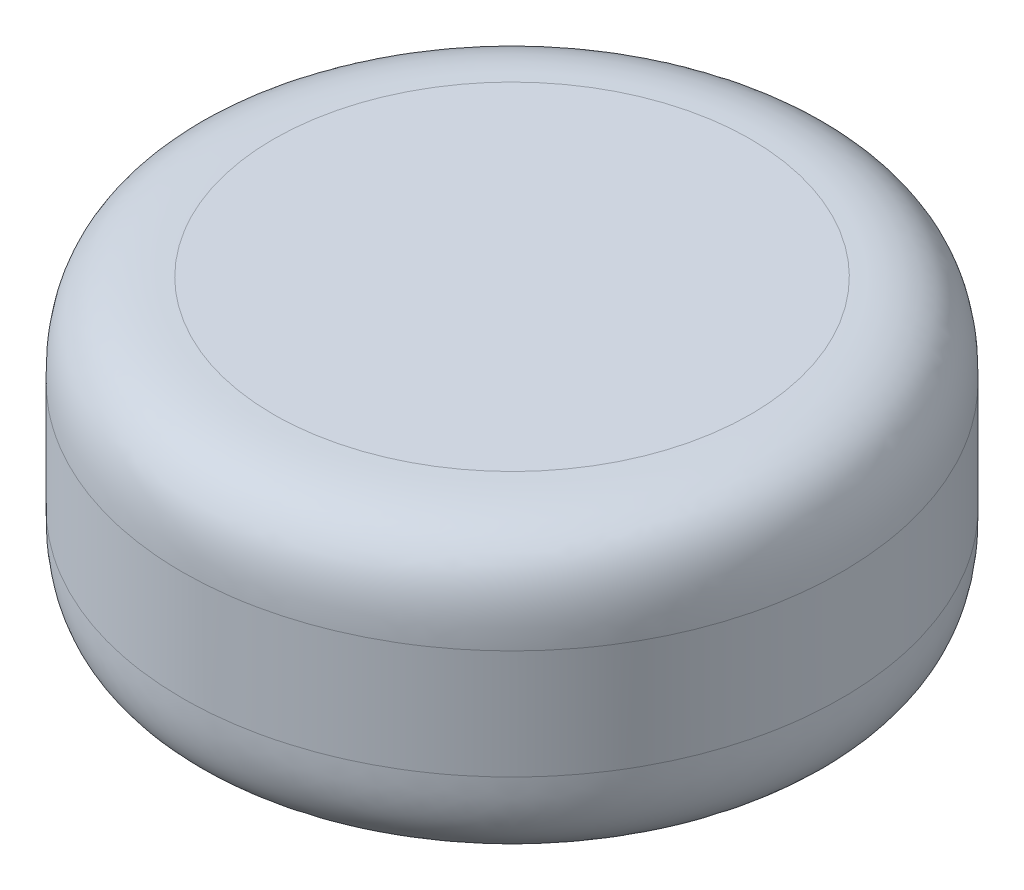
ISO-10303-21;
HEADER;
FILE_DESCRIPTION(('STEP AP214'),'2;1');
FILE_NAME('part.step','',(''),(''),'','','');
FILE_SCHEMA(('AUTOMOTIVE_DESIGN { 1 0 10303 214 1 1 1 1 }'));
ENDSEC;
DATA;
#1=APPLICATION_CONTEXT('core data for automotive mechanical design processes');
#2=APPLICATION_PROTOCOL_DEFINITION('international standard','automotive_design',2000,#1);
#3=PRODUCT_CONTEXT('',#1,'mechanical');
#4=PRODUCT('Part','Part','',(#3));
#5=PRODUCT_RELATED_PRODUCT_CATEGORY('part','',(#4));
#6=PRODUCT_DEFINITION_FORMATION('','',#4);
#7=PRODUCT_DEFINITION_CONTEXT('part definition',#1,'design');
#8=PRODUCT_DEFINITION('design','',#6,#7);
#9=PRODUCT_DEFINITION_SHAPE('','',#8);
#10=(LENGTH_UNIT() NAMED_UNIT(*) SI_UNIT(.MILLI.,.METRE.));
#11=(NAMED_UNIT(*) PLANE_ANGLE_UNIT() SI_UNIT($,.RADIAN.));
#12=(NAMED_UNIT(*) SI_UNIT($,.STERADIAN.) SOLID_ANGLE_UNIT());
#13=UNCERTAINTY_MEASURE_WITH_UNIT(LENGTH_MEASURE(1.E-05),#10,'distance_accuracy_value','');
#14=(GEOMETRIC_REPRESENTATION_CONTEXT(3) GLOBAL_UNCERTAINTY_ASSIGNED_CONTEXT((#13)) GLOBAL_UNIT_ASSIGNED_CONTEXT((#10,
#11,#12)) REPRESENTATION_CONTEXT('',''));
#15=CARTESIAN_POINT('',(0.,0.,0.));
#16=DIRECTION('',(0.,0.,1.));
#17=DIRECTION('',(1.,0.,0.));
#18=AXIS2_PLACEMENT_3D('',#15,#16,#17);
#19=CARTESIAN_POINT('',(-3.33066907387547E-13,4.06399999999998,0.));
#20=DIRECTION('',(0.,-1.,0.));
#21=DIRECTION('',(0.,0.,-1.));
#22=AXIS2_PLACEMENT_3D('',#19,#20,#21);
#23=CYLINDRICAL_SURFACE('',#22,4.5974);
#24=CARTESIAN_POINT('',(0.,2.794,4.59740000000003));
#25=CARTESIAN_POINT('',(0.601717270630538,2.794,4.59740000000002));
#26=CARTESIAN_POINT('',(1.80515181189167,2.794,4.3580219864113));
#27=CARTESIAN_POINT('',(3.3354856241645,2.79399999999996,3.33548562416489));
#28=CARTESIAN_POINT('',(4.35802198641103,2.79399999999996,1.80515181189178));
#29=CARTESIAN_POINT('',(4.71708900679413,2.79399999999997,0.));
#30=CARTESIAN_POINT('',(4.35802198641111,2.79399999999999,-1.80515181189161));
#31=CARTESIAN_POINT('',(3.33548562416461,2.794,-3.33548562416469));
#32=CARTESIAN_POINT('',(1.80515181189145,2.794,-4.35802198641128));
#33=CARTESIAN_POINT('',(-1.38777878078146E-13,2.79399999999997,-4.71708900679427));
#34=CARTESIAN_POINT('',(-1.80515181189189,2.79399999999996,-4.35802198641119));
#35=CARTESIAN_POINT('',(-3.33548562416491,2.79399999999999,-3.33548562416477));
#36=CARTESIAN_POINT('',(-4.35802198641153,2.79399999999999,-1.80515181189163));
#37=CARTESIAN_POINT('',(-4.71708900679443,2.79399999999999,0.));
#38=CARTESIAN_POINT('',(-4.35802198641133,2.79399999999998,1.8051518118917));
#39=CARTESIAN_POINT('',(-3.33548562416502,2.79400000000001,3.33548562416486));
#40=CARTESIAN_POINT('',(-1.80515181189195,2.79400000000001,4.35802198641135));
#41=CARTESIAN_POINT('',(-0.601717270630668,2.794,4.59740000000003));
#42=CARTESIAN_POINT('',(0.,2.794,4.59740000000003));
#43=B_SPLINE_CURVE_WITH_KNOTS('',3,(#24,#25,#26,#27,#28,#29,#30,#31,#32,#33,#34,#35,#36,#37,#38,
#39,#40,#41,#42),.UNSPECIFIED.,.T.,.F.,(4,1,1,1,1,1,1,1,1,1,1,1,1,1,1,1,4),(0.,
0.392699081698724,0.785398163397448,1.17809724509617,1.5707963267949,1.96349540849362,
2.35619449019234,2.74889357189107,3.14159265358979,3.53429173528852,3.92699081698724,
4.31968989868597,4.71238898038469,5.10508806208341,5.49778714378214,5.89048622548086,
6.28318530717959),.UNSPECIFIED.);
#44=CARTESIAN_POINT('',(0.,2.794,4.59740000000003));
#45=VERTEX_POINT('',#44);
#46=EDGE_CURVE('E12',#45,#45,#43,.F.);
#47=ORIENTED_EDGE('',*,*,#46,.T.);
#48=EDGE_LOOP('',(#47));
#49=FACE_BOUND('',#48,.T.);
#50=CARTESIAN_POINT('',(-2.69478449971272E-13,1.26999999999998,4.59740000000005));
#51=CARTESIAN_POINT('',(-0.601717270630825,1.26999999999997,4.59740000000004));
#52=CARTESIAN_POINT('',(-1.80515181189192,1.26999999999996,4.35802198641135));
#53=CARTESIAN_POINT('',(-3.33548562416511,1.26999999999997,3.33548562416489));
#54=CARTESIAN_POINT('',(-4.35802198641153,1.26999999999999,1.80515181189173));
#55=CARTESIAN_POINT('',(-4.71708900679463,1.27000000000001,0.));
#56=CARTESIAN_POINT('',(-4.3580219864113,1.27,-1.8051518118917));
#57=CARTESIAN_POINT('',(-3.3354856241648,1.26999999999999,-3.33548562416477));
#58=CARTESIAN_POINT('',(-1.80515181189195,1.27,-4.35802198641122));
#59=CARTESIAN_POINT('',(-2.4980018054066E-13,1.27,-4.71708900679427));
#60=CARTESIAN_POINT('',(1.80515181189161,1.26999999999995,-4.35802198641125));
#61=CARTESIAN_POINT('',(3.3354856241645,1.26999999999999,-3.33548562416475));
#62=CARTESIAN_POINT('',(4.35802198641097,1.27000000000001,-1.80515181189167));
#63=CARTESIAN_POINT('',(4.71708900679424,1.27,0.));
#64=CARTESIAN_POINT('',(4.35802198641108,1.27000000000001,1.80515181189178));
#65=CARTESIAN_POINT('',(3.33548562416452,1.27,3.33548562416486));
#66=CARTESIAN_POINT('',(1.80515181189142,1.26999999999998,4.35802198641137));
#67=CARTESIAN_POINT('',(0.601717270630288,1.26999999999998,4.59740000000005));
#68=CARTESIAN_POINT('',(-2.68882138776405E-13,1.26999999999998,4.59740000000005));
#69=B_SPLINE_CURVE_WITH_KNOTS('',3,(#50,#51,#52,#53,#54,#55,#56,#57,#58,#59,#60,#61,#62,#63,#64,
#65,#66,#67,#68),.UNSPECIFIED.,.T.,.F.,(4,1,1,1,1,1,1,1,1,1,1,1,1,1,1,1,4),(0.,
0.392699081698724,0.785398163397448,1.17809724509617,1.5707963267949,1.96349540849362,
2.35619449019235,2.74889357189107,3.14159265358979,3.53429173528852,3.92699081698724,
4.31968989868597,4.71238898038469,5.10508806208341,5.49778714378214,5.89048622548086,
6.28318530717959),.UNSPECIFIED.);
#70=CARTESIAN_POINT('',(-2.69478449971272E-13,1.26999999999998,4.59740000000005));
#71=VERTEX_POINT('',#70);
#72=EDGE_CURVE('E69',#71,#71,#69,.F.);
#73=ORIENTED_EDGE('',*,*,#72,.T.);
#74=EDGE_LOOP('',(#73));
#75=FACE_BOUND('',#74,.T.);
#76=ADVANCED_FACE('F46',(#49,#75),#23,.T.);
#77=CARTESIAN_POINT('',(-3.33066907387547E-13,4.06399999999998,0.));
#78=DIRECTION('',(0.,1.,0.));
#79=DIRECTION('',(0.,0.,1.));
#80=AXIS2_PLACEMENT_3D('',#77,#78,#79);
#81=PLANE('',#80);
#82=CARTESIAN_POINT('',(-1.16443313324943E-13,4.06399999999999,3.32740000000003));
#83=CARTESIAN_POINT('',(-0.435497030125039,4.06399999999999,3.32740000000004));
#84=CARTESIAN_POINT('',(-1.30649109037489,4.06400000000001,3.15414850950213));
#85=CARTESIAN_POINT('',(-2.41408075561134,4.06399999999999,2.41408075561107));
#86=CARTESIAN_POINT('',(-3.15414850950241,4.064,1.30649109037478));
#87=CARTESIAN_POINT('',(-3.41402574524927,4.06400000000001,1.38777878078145E-13));
#88=CARTESIAN_POINT('',(-3.15414850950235,4.06399999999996,-1.3064910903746));
#89=CARTESIAN_POINT('',(-2.41408075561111,4.06399999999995,-2.41408075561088));
#90=CARTESIAN_POINT('',(-1.30649109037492,4.06399999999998,-3.15414850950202));
#91=CARTESIAN_POINT('',(0.,4.064,-3.41402574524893));
#92=CARTESIAN_POINT('',(1.30649109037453,4.06399999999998,-3.15414850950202));
#93=CARTESIAN_POINT('',(2.41408075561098,4.06399999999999,-2.41408075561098));
#94=CARTESIAN_POINT('',(3.15414850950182,4.06399999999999,-1.30649109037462));
#95=CARTESIAN_POINT('',(3.41402574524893,4.064,0.));
#96=CARTESIAN_POINT('',(3.15414850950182,4.06399999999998,1.30649109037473));
#97=CARTESIAN_POINT('',(2.41408075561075,4.06400000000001,2.41408075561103));
#98=CARTESIAN_POINT('',(1.30649109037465,4.064,3.1541485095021));
#99=CARTESIAN_POINT('',(0.435497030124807,4.06399999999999,3.32740000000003));
#100=CARTESIAN_POINT('',(-1.16036737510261E-13,4.06399999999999,3.32740000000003));
#101=B_SPLINE_CURVE_WITH_KNOTS('',3,(#82,#83,#84,#85,#86,#87,#88,#89,#90,#91,#92,#93,#94,#95,
#96,#97,#98,#99,#100),.UNSPECIFIED.,.T.,.F.,(4,1,1,1,1,1,1,1,1,1,1,1,1,1,1,1,4),(0.,
0.392699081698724,0.785398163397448,1.17809724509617,1.5707963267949,1.96349540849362,
2.35619449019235,2.74889357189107,3.14159265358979,3.53429173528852,3.92699081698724,
4.31968989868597,4.71238898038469,5.10508806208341,5.49778714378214,5.89048622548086,
6.28318530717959),.UNSPECIFIED.);
#102=CARTESIAN_POINT('',(-1.16443313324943E-13,4.06399999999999,3.32740000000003));
#103=VERTEX_POINT('',#102);
#104=EDGE_CURVE('E59',#103,#103,#101,.F.);
#105=ORIENTED_EDGE('',*,*,#104,.T.);
#106=EDGE_LOOP('',(#105));
#107=FACE_BOUND('',#106,.T.);
#108=ADVANCED_FACE('F92',(#107),#81,.T.);
#109=CARTESIAN_POINT('',(0.,0.,0.));
#110=DIRECTION('',(0.,1.,0.));
#111=DIRECTION('',(0.,0.,1.));
#112=AXIS2_PLACEMENT_3D('',#109,#110,#111);
#113=PLANE('',#112);
#114=CARTESIAN_POINT('',(-2.36301863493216E-13,0.,3.32740000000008));
#115=CARTESIAN_POINT('',(0.435497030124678,0.,3.32740000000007));
#116=CARTESIAN_POINT('',(1.30649109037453,0.,3.15414850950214));
#117=CARTESIAN_POINT('',(2.41408075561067,0.,2.41408075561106));
#118=CARTESIAN_POINT('',(3.15414850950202,0.,1.30649109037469));
#119=CARTESIAN_POINT('',(3.41402574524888,0.,0.));
#120=CARTESIAN_POINT('',(3.1541485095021,0.,-1.30649109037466));
#121=CARTESIAN_POINT('',(2.41408075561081,0.,-2.41408075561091));
#122=CARTESIAN_POINT('',(1.30649109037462,0.,-3.15414850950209));
#123=CARTESIAN_POINT('',(-2.4980018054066E-13,0.,-3.41402574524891));
#124=CARTESIAN_POINT('',(-1.30649109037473,0.,-3.15414850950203));
#125=CARTESIAN_POINT('',(-2.4140807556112,0.,-2.41408075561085));
#126=CARTESIAN_POINT('',(-3.15414850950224,0.,-1.30649109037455));
#127=CARTESIAN_POINT('',(-3.41402574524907,0.,0.));
#128=CARTESIAN_POINT('',(-3.15414850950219,0.,1.30649109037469));
#129=CARTESIAN_POINT('',(-2.41408075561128,0.,2.41408075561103));
#130=CARTESIAN_POINT('',(-1.30649109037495,0.,3.15414850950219));
#131=CARTESIAN_POINT('',(-0.43549703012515,0.,3.32740000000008));
#132=CARTESIAN_POINT('',(-2.3673554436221E-13,0.,3.32740000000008));
#133=B_SPLINE_CURVE_WITH_KNOTS('',3,(#114,#115,#116,#117,#118,#119,#120,#121,#122,#123,#124,
#125,#126,#127,#128,#129,#130,#131,#132),.UNSPECIFIED.,.T.,.F.,(4,1,1,1,1,1,1,1,1,1,1,1,1,1,1,1,
4),(0.,0.392699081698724,0.785398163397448,1.17809724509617,1.5707963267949,1.96349540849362,
2.35619449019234,2.74889357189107,3.14159265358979,3.53429173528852,3.92699081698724,
4.31968989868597,4.71238898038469,5.10508806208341,5.49778714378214,5.89048622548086,
6.28318530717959),.UNSPECIFIED.);
#134=CARTESIAN_POINT('',(-2.36301863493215E-13,0.,3.32740000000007));
#135=VERTEX_POINT('',#134);
#136=EDGE_CURVE('E64',#135,#135,#133,.F.);
#137=ORIENTED_EDGE('',*,*,#136,.T.);
#138=EDGE_LOOP('',(#137));
#139=FACE_BOUND('',#138,.T.);
#140=ADVANCED_FACE('F93',(#139),#113,.F.);
#141=CARTESIAN_POINT('',(-2.68882138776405E-13,1.26999999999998,4.59740000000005));
#142=CARTESIAN_POINT('',(0.601717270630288,1.26999999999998,4.59740000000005));
#143=CARTESIAN_POINT('',(1.80515181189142,1.26999999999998,4.35802198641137));
#144=CARTESIAN_POINT('',(3.33548562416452,1.27,3.33548562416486));
#145=CARTESIAN_POINT('',(4.35802198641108,1.27000000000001,1.80515181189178));
#146=CARTESIAN_POINT('',(4.71708900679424,1.27,0.));
#147=CARTESIAN_POINT('',(4.35802198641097,1.27000000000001,-1.80515181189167));
#148=CARTESIAN_POINT('',(3.3354856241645,1.26999999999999,-3.33548562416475));
#149=CARTESIAN_POINT('',(1.80515181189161,1.26999999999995,-4.35802198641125));
#150=CARTESIAN_POINT('',(-2.4980018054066E-13,1.27,-4.71708900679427));
#151=CARTESIAN_POINT('',(-1.80515181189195,1.27,-4.35802198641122));
#152=CARTESIAN_POINT('',(-3.3354856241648,1.26999999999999,-3.33548562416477));
#153=CARTESIAN_POINT('',(-4.3580219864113,1.27,-1.8051518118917));
#154=CARTESIAN_POINT('',(-4.71708900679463,1.27000000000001,0.));
#155=CARTESIAN_POINT('',(-4.35802198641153,1.26999999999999,1.80515181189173));
#156=CARTESIAN_POINT('',(-3.33548562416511,1.26999999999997,3.33548562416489));
#157=CARTESIAN_POINT('',(-1.80515181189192,1.26999999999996,4.35802198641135));
#158=CARTESIAN_POINT('',(-0.601717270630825,1.26999999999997,4.59740000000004));
#159=CARTESIAN_POINT('',(-2.68882138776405E-13,1.26999999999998,4.59740000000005));
#160=CARTESIAN_POINT('',(-1.81007552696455E-13,1.05638847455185,4.59740000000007));
#161=CARTESIAN_POINT('',(0.601717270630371,1.05638847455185,4.59740000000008));
#162=CARTESIAN_POINT('',(1.8051518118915,1.05638847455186,4.35802198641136));
#163=CARTESIAN_POINT('',(3.33548562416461,1.05638847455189,3.33548562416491));
#164=CARTESIAN_POINT('',(4.35802198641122,1.05638847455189,1.80515181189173));
#165=CARTESIAN_POINT('',(4.71708900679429,1.05638847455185,0.));
#166=CARTESIAN_POINT('',(4.35802198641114,1.05638847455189,-1.80515181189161));
#167=CARTESIAN_POINT('',(3.33548562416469,1.05638847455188,-3.33548562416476));
#168=CARTESIAN_POINT('',(1.80515181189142,1.05638847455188,-4.35802198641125));
#169=CARTESIAN_POINT('',(-1.11022302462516E-13,1.05638847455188,-4.71708900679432));
#170=CARTESIAN_POINT('',(-1.80515181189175,1.05638847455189,-4.3580219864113));
#171=CARTESIAN_POINT('',(-3.33548562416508,1.05638847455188,-3.33548562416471));
#172=CARTESIAN_POINT('',(-4.35802198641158,1.05638847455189,-1.80515181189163));
#173=CARTESIAN_POINT('',(-4.71708900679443,1.05638847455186,0.));
#174=CARTESIAN_POINT('',(-4.35802198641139,1.05638847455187,1.80515181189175));
#175=CARTESIAN_POINT('',(-3.33548562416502,1.05638847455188,3.33548562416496));
#176=CARTESIAN_POINT('',(-1.80515181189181,1.05638847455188,4.35802198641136));
#177=CARTESIAN_POINT('',(-0.601717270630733,1.05638847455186,4.59740000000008));
#178=CARTESIAN_POINT('',(-1.81007552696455E-13,1.05638847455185,4.59740000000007));
#179=CARTESIAN_POINT('',(-2.41072353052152E-13,0.842776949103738,4.59740000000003));
#180=CARTESIAN_POINT('',(0.601717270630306,0.842776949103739,4.59740000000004));
#181=CARTESIAN_POINT('',(1.80515181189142,0.842776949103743,4.35802198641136));
#182=CARTESIAN_POINT('',(3.33548562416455,0.84277694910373,3.33548562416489));
#183=CARTESIAN_POINT('',(4.35802198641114,0.842776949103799,1.80515181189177));
#184=CARTESIAN_POINT('',(4.71708900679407,0.842776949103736,0.));
#185=CARTESIAN_POINT('',(4.35802198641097,0.842776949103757,-1.80515181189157));
#186=CARTESIAN_POINT('',(3.33548562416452,0.842776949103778,-3.33548562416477));
#187=CARTESIAN_POINT('',(1.80515181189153,0.842776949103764,-4.35802198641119));
#188=CARTESIAN_POINT('',(-2.77555756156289E-13,0.842776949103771,-4.71708900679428));
#189=CARTESIAN_POINT('',(-1.805151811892,0.842776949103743,-4.35802198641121));
#190=CARTESIAN_POINT('',(-3.33548562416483,0.842776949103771,-3.33548562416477));
#191=CARTESIAN_POINT('',(-4.3580219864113,0.842776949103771,-1.8051518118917));
#192=CARTESIAN_POINT('',(-4.71708900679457,0.842776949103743,0.));
#193=CARTESIAN_POINT('',(-4.35802198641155,0.842776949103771,1.80515181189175));
#194=CARTESIAN_POINT('',(-3.33548562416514,0.84277694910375,3.33548562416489));
#195=CARTESIAN_POINT('',(-1.80515181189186,0.842776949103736,4.35802198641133));
#196=CARTESIAN_POINT('',(-0.601717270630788,0.842776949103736,4.59740000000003));
#197=CARTESIAN_POINT('',(-2.41072353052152E-13,0.842776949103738,4.59740000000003));
#198=CARTESIAN_POINT('',(-2.54950140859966E-13,0.371974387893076,4.50635126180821));
#199=CARTESIAN_POINT('',(0.58980062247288,0.371974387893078,4.50635126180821));
#200=CARTESIAN_POINT('',(1.76940186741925,0.371974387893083,4.27171398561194));
#201=CARTESIAN_POINT('',(3.26942834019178,0.371974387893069,3.26942834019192));
#202=CARTESIAN_POINT('',(4.27171398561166,0.371974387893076,1.7694018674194));
#203=CARTESIAN_POINT('',(4.6236698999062,0.371974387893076,0.));
#204=CARTESIAN_POINT('',(4.27171398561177,0.371974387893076,-1.76940186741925));
#205=CARTESIAN_POINT('',(3.26942834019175,0.371974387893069,-3.26942834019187));
#206=CARTESIAN_POINT('',(1.76940186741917,0.37197438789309,-4.27171398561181));
#207=CARTESIAN_POINT('',(-3.05311331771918E-13,0.371974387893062,-4.62366989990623));
#208=CARTESIAN_POINT('',(-1.76940186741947,0.371974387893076,-4.27171398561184));
#209=CARTESIAN_POINT('',(-3.26942834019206,0.371974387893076,-3.26942834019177));
#210=CARTESIAN_POINT('',(-4.27171398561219,0.371974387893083,-1.76940186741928));
#211=CARTESIAN_POINT('',(-4.62366989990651,0.37197438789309,0.));
#212=CARTESIAN_POINT('',(-4.27171398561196,0.371974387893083,1.76940186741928));
#213=CARTESIAN_POINT('',(-3.269428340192,0.371974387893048,3.26942834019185));
#214=CARTESIAN_POINT('',(-1.76940186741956,0.371974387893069,4.27171398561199));
#215=CARTESIAN_POINT('',(-0.589800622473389,0.371974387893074,4.50635126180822));
#216=CARTESIAN_POINT('',(-2.54950140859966E-13,0.371974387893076,4.50635126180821));
#217=CARTESIAN_POINT('',(-2.41018142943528E-13,0.0910487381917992,4.225425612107));
#218=CARTESIAN_POINT('',(0.553032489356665,0.0910487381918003,4.225425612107));
#219=CARTESIAN_POINT('',(1.65909746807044,0.0910487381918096,4.00541560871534));
#220=CARTESIAN_POINT('',(3.0656123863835,0.0910487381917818,3.06561238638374));
#221=CARTESIAN_POINT('',(4.00541560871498,0.0910487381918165,1.65909746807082));
#222=CARTESIAN_POINT('',(4.33543061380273,0.0910487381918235,0.));
#223=CARTESIAN_POINT('',(4.00541560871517,0.0910487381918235,-1.65909746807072));
#224=CARTESIAN_POINT('',(3.06561238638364,0.0910487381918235,-3.06561238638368));
#225=CARTESIAN_POINT('',(1.65909746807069,0.0910487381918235,-4.0054156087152));
#226=CARTESIAN_POINT('',(-3.88578058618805E-13,0.0910487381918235,-4.3354306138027));
#227=CARTESIAN_POINT('',(-1.6590974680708,0.0910487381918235,-4.00541560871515));
#228=CARTESIAN_POINT('',(-3.06561238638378,0.0910487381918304,-3.06561238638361));
#229=CARTESIAN_POINT('',(-4.00541560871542,0.0910487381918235,-1.65909746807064));
#230=CARTESIAN_POINT('',(-4.33543061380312,0.0910487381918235,1.11022302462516E-13));
#231=CARTESIAN_POINT('',(-4.00541560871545,0.0910487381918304,1.65909746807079));
#232=CARTESIAN_POINT('',(-3.06561238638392,0.0910487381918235,3.06561238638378));
#233=CARTESIAN_POINT('',(-1.659097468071,0.0910487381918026,4.00541560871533));
#234=CARTESIAN_POINT('',(-0.553032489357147,0.091048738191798,4.22542561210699));
#235=CARTESIAN_POINT('',(-2.41018142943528E-13,0.0910487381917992,4.225425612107));
#236=CARTESIAN_POINT('',(-1.62359275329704E-13,0.,3.75462305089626));
#237=CARTESIAN_POINT('',(0.491412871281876,0.,3.75462305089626));
#238=CARTESIAN_POINT('',(1.47423861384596,0.,3.55912685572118));
#239=CARTESIAN_POINT('',(2.72403776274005,0.,2.72403776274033));
#240=CARTESIAN_POINT('',(3.55912685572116,0.,1.47423861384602));
#241=CARTESIAN_POINT('',(3.85237114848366,0.,0.));
#242=CARTESIAN_POINT('',(3.55912685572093,0.,-1.47423861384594));
#243=CARTESIAN_POINT('',(2.72403776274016,0.,-2.72403776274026));
#244=CARTESIAN_POINT('',(1.47423861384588,0.,-3.55912685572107));
#245=CARTESIAN_POINT('',(-3.33066907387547E-13,0.,-3.85237114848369));
#246=CARTESIAN_POINT('',(-1.47423861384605,0.,-3.55912685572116));
#247=CARTESIAN_POINT('',(-2.72403776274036,0.,-2.72403776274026));
#248=CARTESIAN_POINT('',(-3.5591268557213,0.,-1.47423861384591));
#249=CARTESIAN_POINT('',(-3.85237114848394,0.,1.2490009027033E-13));
#250=CARTESIAN_POINT('',(-3.55912685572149,0.,1.47423861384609));
#251=CARTESIAN_POINT('',(-2.72403776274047,0.,2.72403776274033));
#252=CARTESIAN_POINT('',(-1.47423861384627,0.,3.55912685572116));
#253=CARTESIAN_POINT('',(-0.491412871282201,0.,3.75462305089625));
#254=CARTESIAN_POINT('',(-1.62359275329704E-13,0.,3.75462305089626));
#255=CARTESIAN_POINT('',(0.,0.,3.54101152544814));
#256=CARTESIAN_POINT('',(0.46345495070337,0.,3.54101152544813));
#257=CARTESIAN_POINT('',(1.39036485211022,0.,3.35663768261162));
#258=CARTESIAN_POINT('',(2.56905925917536,0.,2.56905925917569));
#259=CARTESIAN_POINT('',(3.35663768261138,0.,1.39036485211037));
#260=CARTESIAN_POINT('',(3.63319844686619,0.,0.));
#261=CARTESIAN_POINT('',(3.35663768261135,0.,-1.39036485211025));
#262=CARTESIAN_POINT('',(2.56905925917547,0.,-2.56905925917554));
#263=CARTESIAN_POINT('',(1.39036485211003,0.,-3.35663768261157));
#264=CARTESIAN_POINT('',(-2.4980018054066E-13,0.,-3.6331984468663));
#265=CARTESIAN_POINT('',(-1.39036485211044,0.,-3.35663768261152));
#266=CARTESIAN_POINT('',(-2.56905925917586,0.,-2.56905925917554));
#267=CARTESIAN_POINT('',(-3.35663768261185,0.,-1.39036485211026));
#268=CARTESIAN_POINT('',(-3.63319844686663,0.,0.));
#269=CARTESIAN_POINT('',(-3.35663768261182,0.,1.39036485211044));
#270=CARTESIAN_POINT('',(-2.56905925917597,0.,2.56905925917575));
#271=CARTESIAN_POINT('',(-1.39036485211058,0.,3.35663768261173));
#272=CARTESIAN_POINT('',(-0.463454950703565,0.,3.54101152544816));
#273=CARTESIAN_POINT('',(0.,0.,3.54101152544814));
#274=CARTESIAN_POINT('',(-2.36301863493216E-13,0.,3.32740000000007));
#275=CARTESIAN_POINT('',(0.435497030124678,0.,3.32740000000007));
#276=CARTESIAN_POINT('',(1.30649109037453,0.,3.15414850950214));
#277=CARTESIAN_POINT('',(2.41408075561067,0.,2.41408075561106));
#278=CARTESIAN_POINT('',(3.15414850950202,0.,1.30649109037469));
#279=CARTESIAN_POINT('',(3.41402574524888,0.,0.));
#280=CARTESIAN_POINT('',(3.1541485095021,0.,-1.30649109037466));
#281=CARTESIAN_POINT('',(2.41408075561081,0.,-2.41408075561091));
#282=CARTESIAN_POINT('',(1.30649109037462,0.,-3.15414850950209));
#283=CARTESIAN_POINT('',(-2.4980018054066E-13,0.,-3.41402574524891));
#284=CARTESIAN_POINT('',(-1.30649109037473,0.,-3.15414850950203));
#285=CARTESIAN_POINT('',(-2.4140807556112,0.,-2.41408075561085));
#286=CARTESIAN_POINT('',(-3.15414850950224,0.,-1.30649109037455));
#287=CARTESIAN_POINT('',(-3.41402574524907,0.,0.));
#288=CARTESIAN_POINT('',(-3.15414850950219,0.,1.30649109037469));
#289=CARTESIAN_POINT('',(-2.41408075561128,0.,2.41408075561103));
#290=CARTESIAN_POINT('',(-1.30649109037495,0.,3.15414850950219));
#291=CARTESIAN_POINT('',(-0.43549703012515,0.,3.32740000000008));
#292=CARTESIAN_POINT('',(-2.36301863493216E-13,0.,3.32740000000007));
#293=B_SPLINE_SURFACE_WITH_KNOTS('',5,3,((#141,#142,#143,#144,#145,#146,#147,#148,#149,#150,
#151,#152,#153,#154,#155,#156,#157,#158,#159),(#160,#161,#162,#163,#164,#165,#166,#167,#168,
#169,#170,#171,#172,#173,#174,#175,#176,#177,#178),(#179,#180,#181,#182,#183,#184,#185,#186,
#187,#188,#189,#190,#191,#192,#193,#194,#195,#196,#197),(#198,#199,#200,#201,#202,#203,#204,
#205,#206,#207,#208,#209,#210,#211,#212,#213,#214,#215,#216),(#217,#218,#219,#220,#221,#222,
#223,#224,#225,#226,#227,#228,#229,#230,#231,#232,#233,#234,#235),(#236,#237,#238,#239,#240,
#241,#242,#243,#244,#245,#246,#247,#248,#249,#250,#251,#252,#253,#254),(#255,#256,#257,#258,
#259,#260,#261,#262,#263,#264,#265,#266,#267,#268,#269,#270,#271,#272,#273),(#274,#275,#276,
#277,#278,#279,#280,#281,#282,#283,#284,#285,#286,#287,#288,#289,#290,#291,#292)),.UNSPECIFIED.,
.F.,.T.,.F.,(6,2,6),(4,1,1,1,1,1,1,1,1,1,1,1,1,1,1,1,4),(0.,0.5,1.),(0.,0.392699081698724,
0.785398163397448,1.17809724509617,1.5707963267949,1.96349540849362,2.35619449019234,
2.74889357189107,3.14159265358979,3.53429173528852,3.92699081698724,4.31968989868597,
4.71238898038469,5.10508806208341,5.49778714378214,5.89048622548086,6.28318530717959),.UNSPECIFIED.);
#294=ORIENTED_EDGE('',*,*,#136,.F.);
#295=EDGE_LOOP('',(#294));
#296=FACE_BOUND('',#295,.T.);
#297=ORIENTED_EDGE('',*,*,#72,.F.);
#298=EDGE_LOOP('',(#297));
#299=FACE_BOUND('',#298,.T.);
#300=ADVANCED_FACE('F97',(#296,#299),#293,.T.);
#301=CARTESIAN_POINT('',(-1.16036737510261E-13,4.06399999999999,3.32740000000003));
#302=CARTESIAN_POINT('',(0.435497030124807,4.06399999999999,3.32740000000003));
#303=CARTESIAN_POINT('',(1.30649109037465,4.064,3.1541485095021));
#304=CARTESIAN_POINT('',(2.41408075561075,4.06400000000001,2.41408075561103));
#305=CARTESIAN_POINT('',(3.15414850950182,4.06399999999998,1.30649109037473));
#306=CARTESIAN_POINT('',(3.41402574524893,4.064,0.));
#307=CARTESIAN_POINT('',(3.15414850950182,4.06399999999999,-1.30649109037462));
#308=CARTESIAN_POINT('',(2.41408075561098,4.06399999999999,-2.41408075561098));
#309=CARTESIAN_POINT('',(1.30649109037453,4.06399999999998,-3.15414850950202));
#310=CARTESIAN_POINT('',(0.,4.064,-3.41402574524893));
#311=CARTESIAN_POINT('',(-1.30649109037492,4.06399999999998,-3.15414850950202));
#312=CARTESIAN_POINT('',(-2.41408075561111,4.06399999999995,-2.41408075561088));
#313=CARTESIAN_POINT('',(-3.15414850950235,4.06399999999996,-1.3064910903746));
#314=CARTESIAN_POINT('',(-3.41402574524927,4.06400000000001,1.38777878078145E-13));
#315=CARTESIAN_POINT('',(-3.15414850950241,4.064,1.30649109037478));
#316=CARTESIAN_POINT('',(-2.41408075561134,4.06399999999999,2.41408075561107));
#317=CARTESIAN_POINT('',(-1.30649109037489,4.06400000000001,3.15414850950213));
#318=CARTESIAN_POINT('',(-0.435497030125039,4.06399999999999,3.32740000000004));
#319=CARTESIAN_POINT('',(-1.16036737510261E-13,4.06399999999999,3.32740000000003));
#320=CARTESIAN_POINT('',(-1.39238664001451E-13,4.06399999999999,3.54101152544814));
#321=CARTESIAN_POINT('',(0.463454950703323,4.06399999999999,3.54101152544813));
#322=CARTESIAN_POINT('',(1.39036485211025,4.06399999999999,3.35663768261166));
#323=CARTESIAN_POINT('',(2.56905925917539,4.06399999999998,2.56905925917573));
#324=CARTESIAN_POINT('',(3.35663768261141,4.06400000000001,1.39036485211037));
#325=CARTESIAN_POINT('',(3.63319844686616,4.06399999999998,0.));
#326=CARTESIAN_POINT('',(3.35663768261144,4.06399999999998,-1.39036485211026));
#327=CARTESIAN_POINT('',(2.56905925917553,4.064,-2.56905925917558));
#328=CARTESIAN_POINT('',(1.39036485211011,4.06399999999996,-3.35663768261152));
#329=CARTESIAN_POINT('',(-2.22044604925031E-13,4.06399999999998,-3.63319844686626));
#330=CARTESIAN_POINT('',(-1.39036485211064,4.064,-3.35663768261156));
#331=CARTESIAN_POINT('',(-2.56905925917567,4.064,-2.56905925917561));
#332=CARTESIAN_POINT('',(-3.35663768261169,4.06399999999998,-1.39036485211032));
#333=CARTESIAN_POINT('',(-3.63319844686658,4.064,0.));
#334=CARTESIAN_POINT('',(-3.35663768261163,4.06399999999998,1.39036485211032));
#335=CARTESIAN_POINT('',(-2.56905925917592,4.064,2.56905925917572));
#336=CARTESIAN_POINT('',(-1.39036485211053,4.06400000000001,3.35663768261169));
#337=CARTESIAN_POINT('',(-0.463454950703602,4.06399999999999,3.54101152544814));
#338=CARTESIAN_POINT('',(-1.39238664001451E-13,4.06399999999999,3.54101152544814));
#339=CARTESIAN_POINT('',(0.,4.064,3.75462305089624));
#340=CARTESIAN_POINT('',(0.491412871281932,4.064,3.75462305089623));
#341=CARTESIAN_POINT('',(1.4742386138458,4.06399999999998,3.55912685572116));
#342=CARTESIAN_POINT('',(2.72403776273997,4.06399999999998,2.72403776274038));
#343=CARTESIAN_POINT('',(3.55912685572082,4.06399999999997,1.47423861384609));
#344=CARTESIAN_POINT('',(3.85237114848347,4.064,0.));
#345=CARTESIAN_POINT('',(3.55912685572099,4.06400000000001,-1.47423861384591));
#346=CARTESIAN_POINT('',(2.72403776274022,4.06399999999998,-2.72403776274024));
#347=CARTESIAN_POINT('',(1.47423861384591,4.06399999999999,-3.5591268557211));
#348=CARTESIAN_POINT('',(-3.05311331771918E-13,4.06399999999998,-3.8523711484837));
#349=CARTESIAN_POINT('',(-1.47423861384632,4.06400000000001,-3.55912685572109));
#350=CARTESIAN_POINT('',(-2.72403776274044,4.06400000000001,-2.72403776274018));
#351=CARTESIAN_POINT('',(-3.55912685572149,4.06400000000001,-1.47423861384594));
#352=CARTESIAN_POINT('',(-3.85237114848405,4.06399999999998,1.11022302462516E-13));
#353=CARTESIAN_POINT('',(-3.55912685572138,4.06399999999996,1.47423861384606));
#354=CARTESIAN_POINT('',(-2.72403776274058,4.06399999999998,2.72403776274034));
#355=CARTESIAN_POINT('',(-1.4742386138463,4.064,3.55912685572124));
#356=CARTESIAN_POINT('',(-0.491412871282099,4.064,3.75462305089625));
#357=CARTESIAN_POINT('',(0.,4.064,3.75462305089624));
#358=CARTESIAN_POINT('',(-1.06902334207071E-13,3.97295126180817,4.22542561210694));
#359=CARTESIAN_POINT('',(0.553032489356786,3.97295126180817,4.22542561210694));
#360=CARTESIAN_POINT('',(1.65909746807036,3.97295126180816,4.00541560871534));
#361=CARTESIAN_POINT('',(3.06561238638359,3.97295126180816,3.06561238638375));
#362=CARTESIAN_POINT('',(4.00541560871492,3.97295126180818,1.65909746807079));
#363=CARTESIAN_POINT('',(4.3354306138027,3.97295126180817,0.));
#364=CARTESIAN_POINT('',(4.00541560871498,3.97295126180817,-1.65909746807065));
#365=CARTESIAN_POINT('',(3.06561238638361,3.97295126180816,-3.06561238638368));
#366=CARTESIAN_POINT('',(1.65909746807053,3.97295126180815,-4.0054156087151));
#367=CARTESIAN_POINT('',(-3.05311331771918E-13,3.97295126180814,-4.33543061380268));
#368=CARTESIAN_POINT('',(-1.65909746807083,3.97295126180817,-4.00541560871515));
#369=CARTESIAN_POINT('',(-3.06561238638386,3.97295126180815,-3.06561238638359));
#370=CARTESIAN_POINT('',(-4.00541560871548,3.97295126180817,-1.65909746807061));
#371=CARTESIAN_POINT('',(-4.33543061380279,3.97295126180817,0.));
#372=CARTESIAN_POINT('',(-4.0054156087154,3.97295126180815,1.65909746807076));
#373=CARTESIAN_POINT('',(-3.06561238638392,3.97295126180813,3.06561238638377));
#374=CARTESIAN_POINT('',(-1.659097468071,3.97295126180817,4.00541560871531));
#375=CARTESIAN_POINT('',(-0.553032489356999,3.97295126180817,4.22542561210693));
#376=CARTESIAN_POINT('',(-1.06902334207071E-13,3.97295126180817,4.22542561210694));
#377=CARTESIAN_POINT('',(-1.20725911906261E-13,3.6920256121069,4.50635126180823));
#378=CARTESIAN_POINT('',(0.589800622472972,3.6920256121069,4.50635126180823));
#379=CARTESIAN_POINT('',(1.7694018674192,3.69202561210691,4.27171398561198));
#380=CARTESIAN_POINT('',(3.26942834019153,3.69202561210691,3.26942834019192));
#381=CARTESIAN_POINT('',(4.27171398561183,3.69202561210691,1.76940186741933));
#382=CARTESIAN_POINT('',(4.62366989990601,3.69202561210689,0.));
#383=CARTESIAN_POINT('',(4.27171398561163,3.6920256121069,-1.76940186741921));
#384=CARTESIAN_POINT('',(3.2694283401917,3.69202561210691,-3.26942834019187));
#385=CARTESIAN_POINT('',(1.76940186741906,3.69202561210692,-4.27171398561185));
#386=CARTESIAN_POINT('',(0.,3.69202561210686,-4.62366989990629));
#387=CARTESIAN_POINT('',(-1.76940186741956,3.69202561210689,-4.27171398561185));
#388=CARTESIAN_POINT('',(-3.26942834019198,3.69202561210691,-3.26942834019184));
#389=CARTESIAN_POINT('',(-4.27171398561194,3.69202561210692,-1.76940186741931));
#390=CARTESIAN_POINT('',(-4.62366989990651,3.69202561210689,0.));
#391=CARTESIAN_POINT('',(-4.27171398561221,3.69202561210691,1.76940186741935));
#392=CARTESIAN_POINT('',(-3.26942834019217,3.69202561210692,3.26942834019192));
#393=CARTESIAN_POINT('',(-1.76940186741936,3.69202561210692,4.27171398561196));
#394=CARTESIAN_POINT('',(-0.589800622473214,3.6920256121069,4.50635126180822));
#395=CARTESIAN_POINT('',(-1.20725911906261E-13,3.6920256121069,4.50635126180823));
#396=CARTESIAN_POINT('',(0.,3.22122305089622,4.59740000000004));
#397=CARTESIAN_POINT('',(0.601717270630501,3.22122305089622,4.59740000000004));
#398=CARTESIAN_POINT('',(1.80515181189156,3.22122305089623,4.35802198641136));
#399=CARTESIAN_POINT('',(3.33548562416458,3.2212230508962,3.33548562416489));
#400=CARTESIAN_POINT('',(4.358021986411,3.22122305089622,1.80515181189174));
#401=CARTESIAN_POINT('',(4.71708900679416,3.22122305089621,0.));
#402=CARTESIAN_POINT('',(4.35802198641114,3.22122305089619,-1.80515181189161));
#403=CARTESIAN_POINT('',(3.33548562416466,3.22122305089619,-3.33548562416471));
#404=CARTESIAN_POINT('',(1.80515181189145,3.2212230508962,-4.35802198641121));
#405=CARTESIAN_POINT('',(0.,3.22122305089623,-4.71708900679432));
#406=CARTESIAN_POINT('',(-1.80515181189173,3.22122305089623,-4.3580219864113));
#407=CARTESIAN_POINT('',(-3.335485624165,3.22122305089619,-3.33548562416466));
#408=CARTESIAN_POINT('',(-4.3580219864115,3.2212230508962,-1.80515181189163));
#409=CARTESIAN_POINT('',(-4.71708900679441,3.22122305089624,0.));
#410=CARTESIAN_POINT('',(-4.3580219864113,3.22122305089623,1.80515181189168));
#411=CARTESIAN_POINT('',(-3.33548562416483,3.22122305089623,3.33548562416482));
#412=CARTESIAN_POINT('',(-1.80515181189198,3.22122305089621,4.35802198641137));
#413=CARTESIAN_POINT('',(-0.601717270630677,3.22122305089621,4.59740000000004));
#414=CARTESIAN_POINT('',(0.,3.22122305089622,4.59740000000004));
#415=CARTESIAN_POINT('',(-2.13316777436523E-13,3.0076115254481,4.59740000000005));
#416=CARTESIAN_POINT('',(0.601717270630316,3.0076115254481,4.59740000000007));
#417=CARTESIAN_POINT('',(1.80515181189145,3.0076115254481,4.35802198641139));
#418=CARTESIAN_POINT('',(3.33548562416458,3.00761152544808,3.33548562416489));
#419=CARTESIAN_POINT('',(4.35802198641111,3.0076115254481,1.80515181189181));
#420=CARTESIAN_POINT('',(4.7170890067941,3.0076115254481,0.));
#421=CARTESIAN_POINT('',(4.35802198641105,3.0076115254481,-1.80515181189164));
#422=CARTESIAN_POINT('',(3.33548562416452,3.00761152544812,-3.33548562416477));
#423=CARTESIAN_POINT('',(1.80515181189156,3.00761152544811,-4.35802198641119));
#424=CARTESIAN_POINT('',(-2.77555756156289E-13,3.0076115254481,-4.71708900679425));
#425=CARTESIAN_POINT('',(-1.80515181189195,3.00761152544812,-4.35802198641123));
#426=CARTESIAN_POINT('',(-3.33548562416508,3.00761152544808,-3.33548562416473));
#427=CARTESIAN_POINT('',(-4.35802198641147,3.0076115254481,-1.80515181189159));
#428=CARTESIAN_POINT('',(-4.71708900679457,3.00761152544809,0.));
#429=CARTESIAN_POINT('',(-4.3580219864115,3.0076115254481,1.80515181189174));
#430=CARTESIAN_POINT('',(-3.33548562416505,3.00761152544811,3.33548562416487));
#431=CARTESIAN_POINT('',(-1.80515181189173,3.00761152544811,4.3580219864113));
#432=CARTESIAN_POINT('',(-0.601717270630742,3.0076115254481,4.59740000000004));
#433=CARTESIAN_POINT('',(-2.13316777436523E-13,3.0076115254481,4.59740000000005));
#434=CARTESIAN_POINT('',(0.,2.794,4.59740000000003));
#435=CARTESIAN_POINT('',(0.601717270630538,2.794,4.59740000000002));
#436=CARTESIAN_POINT('',(1.80515181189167,2.794,4.3580219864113));
#437=CARTESIAN_POINT('',(3.3354856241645,2.79399999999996,3.33548562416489));
#438=CARTESIAN_POINT('',(4.35802198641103,2.79399999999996,1.80515181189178));
#439=CARTESIAN_POINT('',(4.71708900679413,2.79399999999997,0.));
#440=CARTESIAN_POINT('',(4.35802198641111,2.79399999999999,-1.80515181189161));
#441=CARTESIAN_POINT('',(3.33548562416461,2.794,-3.33548562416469));
#442=CARTESIAN_POINT('',(1.80515181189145,2.794,-4.35802198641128));
#443=CARTESIAN_POINT('',(-1.38777878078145E-13,2.79399999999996,-4.71708900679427));
#444=CARTESIAN_POINT('',(-1.80515181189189,2.79399999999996,-4.35802198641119));
#445=CARTESIAN_POINT('',(-3.33548562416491,2.79399999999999,-3.33548562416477));
#446=CARTESIAN_POINT('',(-4.35802198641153,2.79399999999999,-1.80515181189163));
#447=CARTESIAN_POINT('',(-4.71708900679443,2.79399999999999,0.));
#448=CARTESIAN_POINT('',(-4.35802198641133,2.79399999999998,1.8051518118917));
#449=CARTESIAN_POINT('',(-3.33548562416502,2.794,3.33548562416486));
#450=CARTESIAN_POINT('',(-1.80515181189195,2.794,4.35802198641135));
#451=CARTESIAN_POINT('',(-0.601717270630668,2.794,4.59740000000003));
#452=CARTESIAN_POINT('',(0.,2.794,4.59740000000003));
#453=B_SPLINE_SURFACE_WITH_KNOTS('',5,3,((#301,#302,#303,#304,#305,#306,#307,#308,#309,#310,
#311,#312,#313,#314,#315,#316,#317,#318,#319),(#320,#321,#322,#323,#324,#325,#326,#327,#328,
#329,#330,#331,#332,#333,#334,#335,#336,#337,#338),(#339,#340,#341,#342,#343,#344,#345,#346,
#347,#348,#349,#350,#351,#352,#353,#354,#355,#356,#357),(#358,#359,#360,#361,#362,#363,#364,
#365,#366,#367,#368,#369,#370,#371,#372,#373,#374,#375,#376),(#377,#378,#379,#380,#381,#382,
#383,#384,#385,#386,#387,#388,#389,#390,#391,#392,#393,#394,#395),(#396,#397,#398,#399,#400,
#401,#402,#403,#404,#405,#406,#407,#408,#409,#410,#411,#412,#413,#414),(#415,#416,#417,#418,
#419,#420,#421,#422,#423,#424,#425,#426,#427,#428,#429,#430,#431,#432,#433),(#434,#435,#436,
#437,#438,#439,#440,#441,#442,#443,#444,#445,#446,#447,#448,#449,#450,#451,#452)),.UNSPECIFIED.,
.F.,.T.,.F.,(6,2,6),(4,1,1,1,1,1,1,1,1,1,1,1,1,1,1,1,4),(0.,0.5,1.),(0.,0.392699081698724,
0.785398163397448,1.17809724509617,1.5707963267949,1.96349540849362,2.35619449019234,
2.74889357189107,3.14159265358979,3.53429173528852,3.92699081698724,4.31968989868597,
4.71238898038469,5.10508806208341,5.49778714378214,5.89048622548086,6.28318530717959),.UNSPECIFIED.);
#454=ORIENTED_EDGE('',*,*,#46,.F.);
#455=EDGE_LOOP('',(#454));
#456=FACE_BOUND('',#455,.T.);
#457=ORIENTED_EDGE('',*,*,#104,.F.);
#458=EDGE_LOOP('',(#457));
#459=FACE_BOUND('',#458,.T.);
#460=ADVANCED_FACE('F49',(#456,#459),#453,.T.);
#461=CLOSED_SHELL('',(#76,#108,#140,#300,#460));
#462=MANIFOLD_SOLID_BREP('B2',#461);
#463=ADVANCED_BREP_SHAPE_REPRESENTATION('',(#18,#462),#14);
#464=SHAPE_DEFINITION_REPRESENTATION(#9,#463);
ENDSEC;
END-ISO-10303-21;
